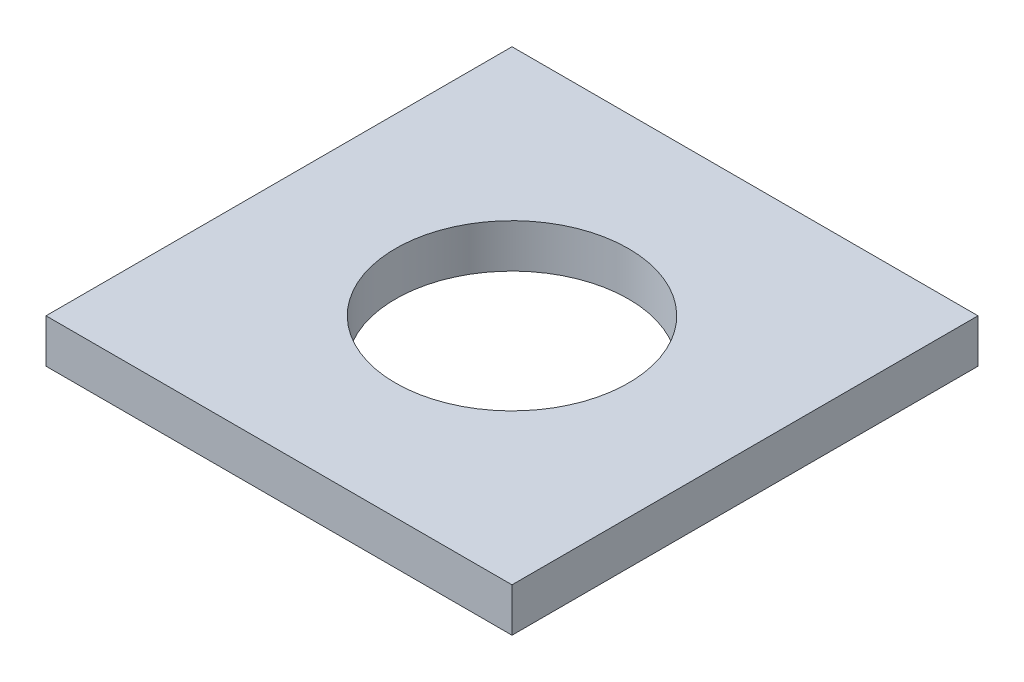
from build123d import *

# Parameters (mm, degrees)
SKETCH1_W           = 50.8
SKETCH1_H           = 50.8
SKETCH1_R           = 12.7
BOSS_EXTRUDE1_DEPTH = 4.7625


with BuildPart() as part:
    # Sketch1 → Boss-Extrude1 (new body)
    with BuildSketch(Plane(origin=(0, 4.7625, 0), x_dir=(-1, 0, 0), z_dir=(0, 1, 0))):
        Rectangle(SKETCH1_W, SKETCH1_H)
        with Locations(Location((0, 0, 0), (0, 0, 90))):
            Circle(SKETCH1_R, mode=Mode.SUBTRACT)
    extrude(amount=-BOSS_EXTRUDE1_DEPTH)


solid = part.part
